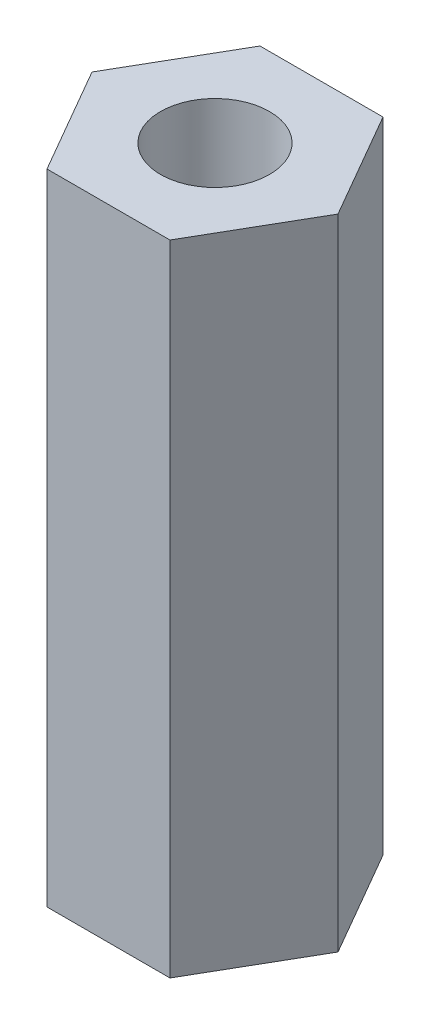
ISO-10303-21;
HEADER;
FILE_DESCRIPTION(('STEP AP214'),'2;1');
FILE_NAME('part.step','',(''),(''),'','','');
FILE_SCHEMA(('AUTOMOTIVE_DESIGN { 1 0 10303 214 1 1 1 1 }'));
ENDSEC;
DATA;
#1=APPLICATION_CONTEXT('core data for automotive mechanical design processes');
#2=APPLICATION_PROTOCOL_DEFINITION('international standard','automotive_design',2000,#1);
#3=PRODUCT_CONTEXT('',#1,'mechanical');
#4=PRODUCT('Part','Part','',(#3));
#5=PRODUCT_RELATED_PRODUCT_CATEGORY('part','',(#4));
#6=PRODUCT_DEFINITION_FORMATION('','',#4);
#7=PRODUCT_DEFINITION_CONTEXT('part definition',#1,'design');
#8=PRODUCT_DEFINITION('design','',#6,#7);
#9=PRODUCT_DEFINITION_SHAPE('','',#8);
#10=(LENGTH_UNIT() NAMED_UNIT(*) SI_UNIT(.MILLI.,.METRE.));
#11=(NAMED_UNIT(*) PLANE_ANGLE_UNIT() SI_UNIT($,.RADIAN.));
#12=(NAMED_UNIT(*) SI_UNIT($,.STERADIAN.) SOLID_ANGLE_UNIT());
#13=UNCERTAINTY_MEASURE_WITH_UNIT(LENGTH_MEASURE(1.E-05),#10,'distance_accuracy_value','');
#14=(GEOMETRIC_REPRESENTATION_CONTEXT(3) GLOBAL_UNCERTAINTY_ASSIGNED_CONTEXT((#13)) GLOBAL_UNIT_ASSIGNED_CONTEXT((#10,
#11,#12)) REPRESENTATION_CONTEXT('',''));
#15=CARTESIAN_POINT('',(0.,0.,0.));
#16=DIRECTION('',(0.,0.,1.));
#17=DIRECTION('',(1.,0.,0.));
#18=AXIS2_PLACEMENT_3D('',#15,#16,#17);
#19=CARTESIAN_POINT('',(0.,19.05,0.));
#20=DIRECTION('',(0.,1.,0.));
#21=DIRECTION('',(0.,0.,1.));
#22=AXIS2_PLACEMENT_3D('',#19,#20,#21);
#23=PLANE('',#22);
#24=DIRECTION('',(-0.500000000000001,0.,-0.866025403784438));
#25=VECTOR('',#24,1.);
#26=CARTESIAN_POINT('',(3.66617420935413,19.05,0.));
#27=LINE('',#26,#25);
#28=CARTESIAN_POINT('',(3.66617420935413,19.05,0.));
#29=VERTEX_POINT('',#28);
#30=CARTESIAN_POINT('',(1.83308710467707,19.05,-3.175));
#31=VERTEX_POINT('',#30);
#32=EDGE_CURVE('E128',#29,#31,#27,.T.);
#33=ORIENTED_EDGE('',*,*,#32,.T.);
#34=DIRECTION('',(-1.,0.,0.));
#35=VECTOR('',#34,1.);
#36=CARTESIAN_POINT('',(1.83308710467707,19.05,-3.175));
#37=LINE('',#36,#35);
#38=CARTESIAN_POINT('',(-1.83308710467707,19.05,-3.175));
#39=VERTEX_POINT('',#38);
#40=EDGE_CURVE('E86',#31,#39,#37,.T.);
#41=ORIENTED_EDGE('',*,*,#40,.T.);
#42=DIRECTION('',(-0.500000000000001,0.,0.866025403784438));
#43=VECTOR('',#42,1.);
#44=CARTESIAN_POINT('',(-1.83308710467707,19.05,-3.175));
#45=LINE('',#44,#43);
#46=CARTESIAN_POINT('',(-3.66617420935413,19.05,0.));
#47=VERTEX_POINT('',#46);
#48=EDGE_CURVE('E99',#39,#47,#45,.T.);
#49=ORIENTED_EDGE('',*,*,#48,.T.);
#50=DIRECTION('',(0.5,0.,0.866025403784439));
#51=VECTOR('',#50,1.);
#52=CARTESIAN_POINT('',(-3.66617420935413,19.05,0.));
#53=LINE('',#52,#51);
#54=CARTESIAN_POINT('',(-1.83308710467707,19.05,3.175));
#55=VERTEX_POINT('',#54);
#56=EDGE_CURVE('E93',#47,#55,#53,.T.);
#57=ORIENTED_EDGE('',*,*,#56,.T.);
#58=DIRECTION('',(1.,0.,0.));
#59=VECTOR('',#58,1.);
#60=CARTESIAN_POINT('',(-1.83308710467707,19.05,3.175));
#61=LINE('',#60,#59);
#62=CARTESIAN_POINT('',(1.83308710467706,19.05,3.175));
#63=VERTEX_POINT('',#62);
#64=EDGE_CURVE('E97',#55,#63,#61,.T.);
#65=ORIENTED_EDGE('',*,*,#64,.T.);
#66=DIRECTION('',(0.500000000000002,0.,-0.866025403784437));
#67=VECTOR('',#66,1.);
#68=CARTESIAN_POINT('',(1.83308710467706,19.05,3.175));
#69=LINE('',#68,#67);
#70=EDGE_CURVE('E49',#63,#29,#69,.T.);
#71=ORIENTED_EDGE('',*,*,#70,.T.);
#72=EDGE_LOOP('',(#33,#41,#49,#57,#65,#71));
#73=FACE_BOUND('',#72,.T.);
#74=CARTESIAN_POINT('',(0.,19.05,0.));
#75=DIRECTION('',(0.,1.,0.));
#76=DIRECTION('',(0.,0.,1.));
#77=AXIS2_PLACEMENT_3D('',#74,#75,#76);
#78=CIRCLE('',#77,1.6256);
#79=CARTESIAN_POINT('',(0.,19.05,-1.6256));
#80=VERTEX_POINT('',#79);
#81=EDGE_CURVE('E121',#80,#80,#78,.T.);
#82=ORIENTED_EDGE('',*,*,#81,.F.);
#83=EDGE_LOOP('',(#82));
#84=FACE_BOUND('',#83,.T.);
#85=ADVANCED_FACE('F32',(#73,#84),#23,.T.);
#86=CARTESIAN_POINT('',(0.,0.,0.));
#87=DIRECTION('',(0.,1.,0.));
#88=DIRECTION('',(0.,0.,1.));
#89=AXIS2_PLACEMENT_3D('',#86,#87,#88);
#90=PLANE('',#89);
#91=DIRECTION('',(-0.500000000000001,0.,-0.866025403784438));
#92=VECTOR('',#91,1.);
#93=CARTESIAN_POINT('',(3.66617420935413,0.,0.));
#94=LINE('',#93,#92);
#95=CARTESIAN_POINT('',(3.66617420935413,0.,0.));
#96=VERTEX_POINT('',#95);
#97=CARTESIAN_POINT('',(1.83308710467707,0.,-3.175));
#98=VERTEX_POINT('',#97);
#99=EDGE_CURVE('E117',#96,#98,#94,.T.);
#100=ORIENTED_EDGE('',*,*,#99,.F.);
#101=DIRECTION('',(0.500000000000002,0.,-0.866025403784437));
#102=VECTOR('',#101,1.);
#103=CARTESIAN_POINT('',(1.83308710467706,0.,3.175));
#104=LINE('',#103,#102);
#105=CARTESIAN_POINT('',(1.83308710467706,0.,3.175));
#106=VERTEX_POINT('',#105);
#107=EDGE_CURVE('E78',#106,#96,#104,.T.);
#108=ORIENTED_EDGE('',*,*,#107,.F.);
#109=DIRECTION('',(1.,0.,0.));
#110=VECTOR('',#109,1.);
#111=CARTESIAN_POINT('',(-1.83308710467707,0.,3.175));
#112=LINE('',#111,#110);
#113=CARTESIAN_POINT('',(-1.83308710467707,0.,3.175));
#114=VERTEX_POINT('',#113);
#115=EDGE_CURVE('E72',#114,#106,#112,.T.);
#116=ORIENTED_EDGE('',*,*,#115,.F.);
#117=DIRECTION('',(0.5,0.,0.866025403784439));
#118=VECTOR('',#117,1.);
#119=CARTESIAN_POINT('',(-3.66617420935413,0.,0.));
#120=LINE('',#119,#118);
#121=CARTESIAN_POINT('',(-3.66617420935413,0.,0.));
#122=VERTEX_POINT('',#121);
#123=EDGE_CURVE('E107',#122,#114,#120,.T.);
#124=ORIENTED_EDGE('',*,*,#123,.F.);
#125=DIRECTION('',(-0.500000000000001,0.,0.866025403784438));
#126=VECTOR('',#125,1.);
#127=CARTESIAN_POINT('',(-1.83308710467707,0.,-3.175));
#128=LINE('',#127,#126);
#129=CARTESIAN_POINT('',(-1.83308710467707,0.,-3.175));
#130=VERTEX_POINT('',#129);
#131=EDGE_CURVE('E123',#130,#122,#128,.T.);
#132=ORIENTED_EDGE('',*,*,#131,.F.);
#133=DIRECTION('',(-1.,0.,0.));
#134=VECTOR('',#133,1.);
#135=CARTESIAN_POINT('',(1.83308710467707,0.,-3.175));
#136=LINE('',#135,#134);
#137=EDGE_CURVE('E120',#98,#130,#136,.T.);
#138=ORIENTED_EDGE('',*,*,#137,.F.);
#139=EDGE_LOOP('',(#100,#108,#116,#124,#132,#138));
#140=FACE_BOUND('',#139,.T.);
#141=CARTESIAN_POINT('',(0.,0.,0.));
#142=DIRECTION('',(0.,1.,0.));
#143=DIRECTION('',(0.,0.,1.));
#144=AXIS2_PLACEMENT_3D('',#141,#142,#143);
#145=CIRCLE('',#144,1.6256);
#146=CARTESIAN_POINT('',(0.,0.,-1.6256));
#147=VERTEX_POINT('',#146);
#148=EDGE_CURVE('E221',#147,#147,#145,.T.);
#149=ORIENTED_EDGE('',*,*,#148,.T.);
#150=EDGE_LOOP('',(#149));
#151=FACE_BOUND('',#150,.T.);
#152=ADVANCED_FACE('F137',(#140,#151),#90,.F.);
#153=CARTESIAN_POINT('',(3.66617420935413,19.05,0.));
#154=DIRECTION('',(-0.866025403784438,0.,0.500000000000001));
#155=DIRECTION('',(0.500000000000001,0.,0.866025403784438));
#156=AXIS2_PLACEMENT_3D('',#153,#154,#155);
#157=PLANE('',#156);
#158=ORIENTED_EDGE('',*,*,#99,.T.);
#159=DIRECTION('',(0.,-1.,0.));
#160=VECTOR('',#159,1.);
#161=CARTESIAN_POINT('',(1.83308710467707,19.05,-3.175));
#162=LINE('',#161,#160);
#163=EDGE_CURVE('E11',#31,#98,#162,.T.);
#164=ORIENTED_EDGE('',*,*,#163,.F.);
#165=ORIENTED_EDGE('',*,*,#32,.F.);
#166=DIRECTION('',(0.,-1.,0.));
#167=VECTOR('',#166,1.);
#168=CARTESIAN_POINT('',(3.66617420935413,19.05,0.));
#169=LINE('',#168,#167);
#170=EDGE_CURVE('E113',#29,#96,#169,.T.);
#171=ORIENTED_EDGE('',*,*,#170,.T.);
#172=EDGE_LOOP('',(#158,#164,#165,#171));
#173=FACE_BOUND('',#172,.T.);
#174=ADVANCED_FACE('F34',(#173),#157,.F.);
#175=CARTESIAN_POINT('',(1.83308710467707,19.05,-3.175));
#176=DIRECTION('',(0.,0.,1.));
#177=DIRECTION('',(1.,0.,0.));
#178=AXIS2_PLACEMENT_3D('',#175,#176,#177);
#179=PLANE('',#178);
#180=ORIENTED_EDGE('',*,*,#137,.T.);
#181=DIRECTION('',(0.,-1.,0.));
#182=VECTOR('',#181,1.);
#183=CARTESIAN_POINT('',(-1.83308710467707,19.05,-3.175));
#184=LINE('',#183,#182);
#185=EDGE_CURVE('E41',#39,#130,#184,.T.);
#186=ORIENTED_EDGE('',*,*,#185,.F.);
#187=ORIENTED_EDGE('',*,*,#40,.F.);
#188=ORIENTED_EDGE('',*,*,#163,.T.);
#189=EDGE_LOOP('',(#180,#186,#187,#188));
#190=FACE_BOUND('',#189,.T.);
#191=ADVANCED_FACE('F162',(#190),#179,.F.);
#192=CARTESIAN_POINT('',(-1.83308710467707,19.05,-3.175));
#193=DIRECTION('',(0.866025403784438,0.,0.500000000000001));
#194=DIRECTION('',(0.500000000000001,0.,-0.866025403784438));
#195=AXIS2_PLACEMENT_3D('',#192,#193,#194);
#196=PLANE('',#195);
#197=ORIENTED_EDGE('',*,*,#131,.T.);
#198=DIRECTION('',(0.,-1.,0.));
#199=VECTOR('',#198,1.);
#200=CARTESIAN_POINT('',(-3.66617420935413,19.05,0.));
#201=LINE('',#200,#199);
#202=EDGE_CURVE('E108',#47,#122,#201,.T.);
#203=ORIENTED_EDGE('',*,*,#202,.F.);
#204=ORIENTED_EDGE('',*,*,#48,.F.);
#205=ORIENTED_EDGE('',*,*,#185,.T.);
#206=EDGE_LOOP('',(#197,#203,#204,#205));
#207=FACE_BOUND('',#206,.T.);
#208=ADVANCED_FACE('F134',(#207),#196,.F.);
#209=CARTESIAN_POINT('',(-3.66617420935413,19.05,0.));
#210=DIRECTION('',(0.866025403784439,0.,-0.5));
#211=DIRECTION('',(-0.5,0.,-0.866025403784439));
#212=AXIS2_PLACEMENT_3D('',#209,#210,#211);
#213=PLANE('',#212);
#214=ORIENTED_EDGE('',*,*,#123,.T.);
#215=DIRECTION('',(0.,-1.,0.));
#216=VECTOR('',#215,1.);
#217=CARTESIAN_POINT('',(-1.83308710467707,19.05,3.175));
#218=LINE('',#217,#216);
#219=EDGE_CURVE('E104',#55,#114,#218,.T.);
#220=ORIENTED_EDGE('',*,*,#219,.F.);
#221=ORIENTED_EDGE('',*,*,#56,.F.);
#222=ORIENTED_EDGE('',*,*,#202,.T.);
#223=EDGE_LOOP('',(#214,#220,#221,#222));
#224=FACE_BOUND('',#223,.T.);
#225=ADVANCED_FACE('F105',(#224),#213,.F.);
#226=CARTESIAN_POINT('',(-1.83308710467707,19.05,3.175));
#227=DIRECTION('',(0.,0.,-1.));
#228=DIRECTION('',(-1.,0.,0.));
#229=AXIS2_PLACEMENT_3D('',#226,#227,#228);
#230=PLANE('',#229);
#231=ORIENTED_EDGE('',*,*,#115,.T.);
#232=DIRECTION('',(0.,-1.,0.));
#233=VECTOR('',#232,1.);
#234=CARTESIAN_POINT('',(1.83308710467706,19.05,3.175));
#235=LINE('',#234,#233);
#236=EDGE_CURVE('E109',#63,#106,#235,.T.);
#237=ORIENTED_EDGE('',*,*,#236,.F.);
#238=ORIENTED_EDGE('',*,*,#64,.F.);
#239=ORIENTED_EDGE('',*,*,#219,.T.);
#240=EDGE_LOOP('',(#231,#237,#238,#239));
#241=FACE_BOUND('',#240,.T.);
#242=ADVANCED_FACE('F111',(#241),#230,.F.);
#243=CARTESIAN_POINT('',(1.83308710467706,19.05,3.175));
#244=DIRECTION('',(-0.866025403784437,0.,-0.500000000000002));
#245=DIRECTION('',(-0.500000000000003,0.,0.866025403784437));
#246=AXIS2_PLACEMENT_3D('',#243,#244,#245);
#247=PLANE('',#246);
#248=ORIENTED_EDGE('',*,*,#107,.T.);
#249=ORIENTED_EDGE('',*,*,#170,.F.);
#250=ORIENTED_EDGE('',*,*,#70,.F.);
#251=ORIENTED_EDGE('',*,*,#236,.T.);
#252=EDGE_LOOP('',(#248,#249,#250,#251));
#253=FACE_BOUND('',#252,.T.);
#254=ADVANCED_FACE('F142',(#253),#247,.F.);
#255=CARTESIAN_POINT('',(0.,19.05,0.));
#256=DIRECTION('',(0.,-1.,0.));
#257=DIRECTION('',(0.,0.,-1.));
#258=AXIS2_PLACEMENT_3D('',#255,#256,#257);
#259=CYLINDRICAL_SURFACE('',#258,1.6256);
#260=CARTESIAN_POINT('',(0.,19.05,-1.6256));
#261=CARTESIAN_POINT('',(0.,18.8515625,-1.6256));
#262=CARTESIAN_POINT('',(0.,18.653125,-1.6256));
#263=CARTESIAN_POINT('',(0.,18.25625,-1.6256));
#264=CARTESIAN_POINT('',(0.,18.0578125,-1.6256));
#265=CARTESIAN_POINT('',(0.,17.6609375,-1.6256));
#266=CARTESIAN_POINT('',(0.,17.4625,-1.6256));
#267=CARTESIAN_POINT('',(0.,17.065625,-1.6256));
#268=CARTESIAN_POINT('',(0.,16.8671875,-1.6256));
#269=CARTESIAN_POINT('',(0.,16.4703125,-1.6256));
#270=CARTESIAN_POINT('',(0.,16.271875,-1.6256));
#271=CARTESIAN_POINT('',(0.,15.875,-1.6256));
#272=CARTESIAN_POINT('',(0.,15.6765625,-1.6256));
#273=CARTESIAN_POINT('',(0.,15.2796875,-1.6256));
#274=CARTESIAN_POINT('',(0.,15.08125,-1.6256));
#275=CARTESIAN_POINT('',(0.,14.684375,-1.6256));
#276=CARTESIAN_POINT('',(0.,14.4859375,-1.6256));
#277=CARTESIAN_POINT('',(0.,14.0890625,-1.6256));
#278=CARTESIAN_POINT('',(0.,13.890625,-1.6256));
#279=CARTESIAN_POINT('',(0.,13.49375,-1.6256));
#280=CARTESIAN_POINT('',(0.,13.2953125,-1.6256));
#281=CARTESIAN_POINT('',(0.,12.8984375,-1.6256));
#282=CARTESIAN_POINT('',(0.,12.7,-1.6256));
#283=CARTESIAN_POINT('',(0.,12.303125,-1.6256));
#284=CARTESIAN_POINT('',(0.,12.1046875,-1.6256));
#285=CARTESIAN_POINT('',(0.,11.7078125,-1.6256));
#286=CARTESIAN_POINT('',(0.,11.509375,-1.6256));
#287=CARTESIAN_POINT('',(0.,11.1125,-1.6256));
#288=CARTESIAN_POINT('',(0.,10.9140625,-1.6256));
#289=CARTESIAN_POINT('',(0.,10.5171875,-1.6256));
#290=CARTESIAN_POINT('',(0.,10.31875,-1.6256));
#291=CARTESIAN_POINT('',(0.,9.921875,-1.6256));
#292=CARTESIAN_POINT('',(0.,9.7234375,-1.6256));
#293=CARTESIAN_POINT('',(0.,9.3265625,-1.6256));
#294=CARTESIAN_POINT('',(0.,9.128125,-1.6256));
#295=CARTESIAN_POINT('',(0.,8.73125,-1.6256));
#296=CARTESIAN_POINT('',(0.,8.5328125,-1.6256));
#297=CARTESIAN_POINT('',(0.,8.1359375,-1.6256));
#298=CARTESIAN_POINT('',(0.,7.9375,-1.6256));
#299=CARTESIAN_POINT('',(0.,7.540625,-1.6256));
#300=CARTESIAN_POINT('',(0.,7.3421875,-1.6256));
#301=CARTESIAN_POINT('',(0.,6.9453125,-1.6256));
#302=CARTESIAN_POINT('',(0.,6.746875,-1.6256));
#303=CARTESIAN_POINT('',(0.,6.35,-1.6256));
#304=CARTESIAN_POINT('',(0.,6.1515625,-1.6256));
#305=CARTESIAN_POINT('',(0.,5.7546875,-1.6256));
#306=CARTESIAN_POINT('',(0.,5.55625,-1.6256));
#307=CARTESIAN_POINT('',(0.,5.159375,-1.6256));
#308=CARTESIAN_POINT('',(0.,4.9609375,-1.6256));
#309=CARTESIAN_POINT('',(0.,4.5640625,-1.6256));
#310=CARTESIAN_POINT('',(0.,4.365625,-1.6256));
#311=CARTESIAN_POINT('',(0.,3.96875,-1.6256));
#312=CARTESIAN_POINT('',(0.,3.7703125,-1.6256));
#313=CARTESIAN_POINT('',(0.,3.3734375,-1.6256));
#314=CARTESIAN_POINT('',(0.,3.175,-1.6256));
#315=CARTESIAN_POINT('',(0.,2.778125,-1.6256));
#316=CARTESIAN_POINT('',(0.,2.5796875,-1.6256));
#317=CARTESIAN_POINT('',(0.,2.1828125,-1.6256));
#318=CARTESIAN_POINT('',(0.,1.984375,-1.6256));
#319=CARTESIAN_POINT('',(0.,1.5875,-1.6256));
#320=CARTESIAN_POINT('',(0.,1.3890625,-1.6256));
#321=CARTESIAN_POINT('',(0.,0.992187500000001,-1.6256));
#322=CARTESIAN_POINT('',(0.,0.793750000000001,-1.6256));
#323=CARTESIAN_POINT('',(0.,0.396875,-1.6256));
#324=CARTESIAN_POINT('',(0.,0.1984375,-1.6256));
#325=CARTESIAN_POINT('',(0.,0.,-1.6256));
#326=B_SPLINE_CURVE_WITH_KNOTS('',3,(#260,#261,#262,#263,#264,#265,#266,#267,#268,#269,#270,
#271,#272,#273,#274,#275,#276,#277,#278,#279,#280,#281,#282,#283,#284,#285,#286,#287,#288,#289,
#290,#291,#292,#293,#294,#295,#296,#297,#298,#299,#300,#301,#302,#303,#304,#305,#306,#307,#308,
#309,#310,#311,#312,#313,#314,#315,#316,#317,#318,#319,#320,#321,#322,#323,#324,#325),
.UNSPECIFIED.,.F.,.F.,(4,2,2,2,2,2,2,2,2,2,2,2,2,2,2,2,2,2,2,2,2,2,2,2,2,2,2,2,2,2,2,2,4),(0.,
0.595312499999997,1.190625,1.7859375,2.38125,2.9765625,3.571875,4.1671875,4.7625,5.3578125,
5.953125,6.5484375,7.14375,7.7390625,8.334375,8.9296875,9.525,10.1203125,10.715625,11.3109375,
11.90625,12.5015625,13.096875,13.6921875,14.2875,14.8828125,15.478125,16.0734375,16.66875,
17.2640625,17.859375,18.4546875,19.05),.UNSPECIFIED.);
#327=EDGE_CURVE('BSEAM144',#80,#147,#326,.T.);
#328=ORIENTED_EDGE('',*,*,#81,.T.);
#329=ORIENTED_EDGE('',*,*,#148,.F.);
#330=ORIENTED_EDGE('',*,*,#327,.T.);
#331=ORIENTED_EDGE('',*,*,#327,.F.);
#332=EDGE_LOOP('',(#328,#330,#329,#331));
#333=FACE_BOUND('',#332,.T.);
#334=ADVANCED_FACE('F144',(#333),#259,.F.);
#335=CLOSED_SHELL('',(#85,#152,#174,#191,#208,#225,#242,#254,#334));
#336=MANIFOLD_SOLID_BREP('B2',#335);
#337=ADVANCED_BREP_SHAPE_REPRESENTATION('',(#18,#336),#14);
#338=SHAPE_DEFINITION_REPRESENTATION(#9,#337);
ENDSEC;
END-ISO-10303-21;
